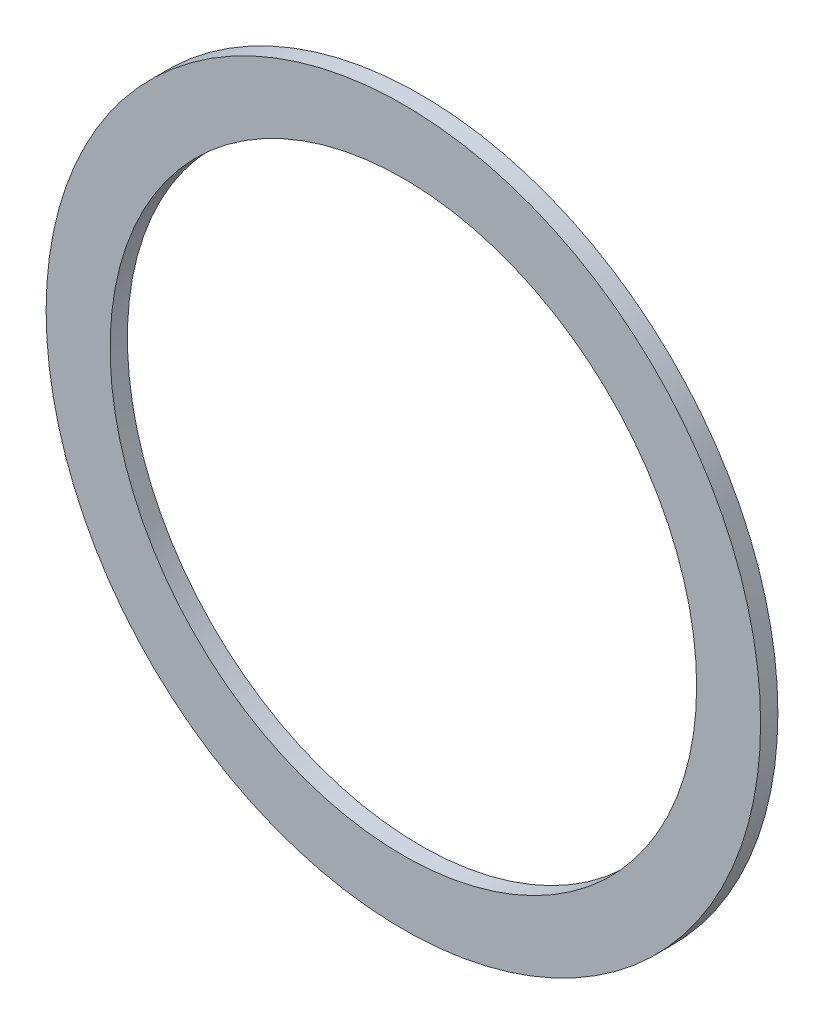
from build123d import *

# Parameters (mm, degrees)
SKETCH1_R          = 7.874
SKETCH1_R_2        = 6.4643
BASE_EXTRUDE_DEPTH = 0.381


with BuildPart() as part:
    # Sketch1 → Base-Extrude (new body)
    with BuildSketch(Plane.XY):
        Circle(SKETCH1_R)
        Circle(SKETCH1_R_2, mode=Mode.SUBTRACT)
    extrude(amount=-BASE_EXTRUDE_DEPTH)


solid = part.part
